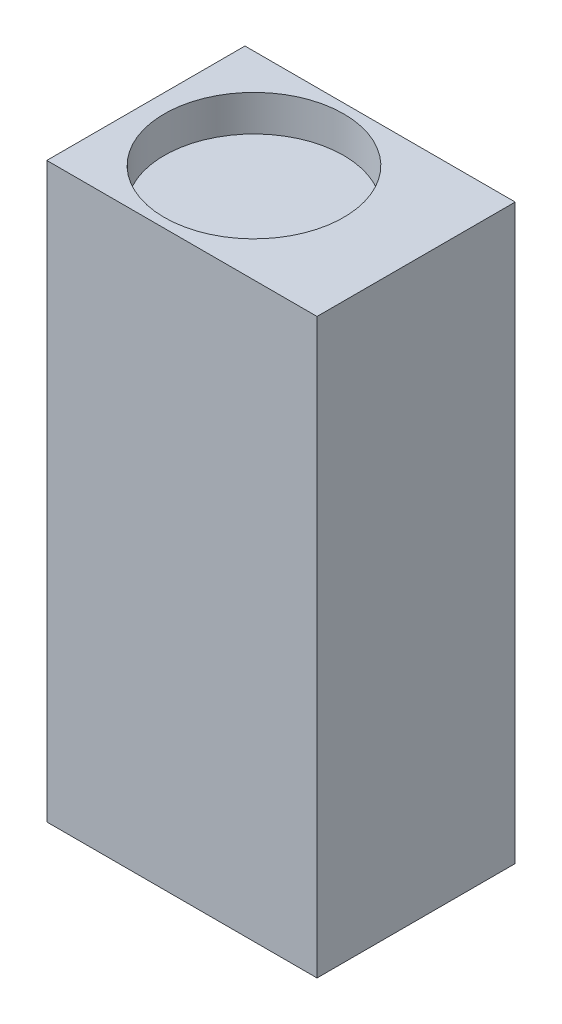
from build123d import *

# Parameters (mm, degrees)
SKETCH1_W                   = 95.25
SKETCH1_H                   = 201.93
BOSS_EXTRUDE1_DEPTH         = 34.925
SKETCH2_R                   = 31.623
CUT_EXTRUDE1_DEPTH          = 12.7
F_3_8_16_TAPPED_HOLE1_D     = 7.9375
F_3_8_16_TAPPED_HOLE1_DEPTH = 23.8125
F_3_8_16_TAPPED_HOLE1_TIP   = 2.384665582


with BuildPart() as part:
    # Sketch1 → Boss-Extrude1 (new, symmetric)
    with BuildSketch(Plane.XY):
        with Locations((9.525, -100.965)):
            Rectangle(SKETCH1_W, SKETCH1_H)
    extrude(amount=BOSS_EXTRUDE1_DEPTH, both=True)

    # Sketch2 → Cut-Extrude1 (cut)
    with BuildSketch(Plane(origin=(0, 0, 0), x_dir=(1, 0, 0), z_dir=(0, 1, 0))):
        with Locations(Location((0, 0, 0), (0, 0, 270))):
            Circle(SKETCH2_R)
    extrude(amount=-CUT_EXTRUDE1_DEPTH, mode=Mode.SUBTRACT)

    # 3_8-16 Tapped Hole1
    with Locations(Plane(origin=(0, -201.93, 0), x_dir=(-1, 0, 0), z_dir=(0, -1, 0))):
        with Locations((25.4, 0), (-44.45, 0)):
            Hole(F_3_8_16_TAPPED_HOLE1_D / 2, depth=F_3_8_16_TAPPED_HOLE1_DEPTH)
            with Locations((0, 0, -(F_3_8_16_TAPPED_HOLE1_DEPTH + F_3_8_16_TAPPED_HOLE1_TIP / 2))):  # 118° drill point
                Cone(0, F_3_8_16_TAPPED_HOLE1_D / 2, F_3_8_16_TAPPED_HOLE1_TIP, mode=Mode.SUBTRACT)


solid = part.part
